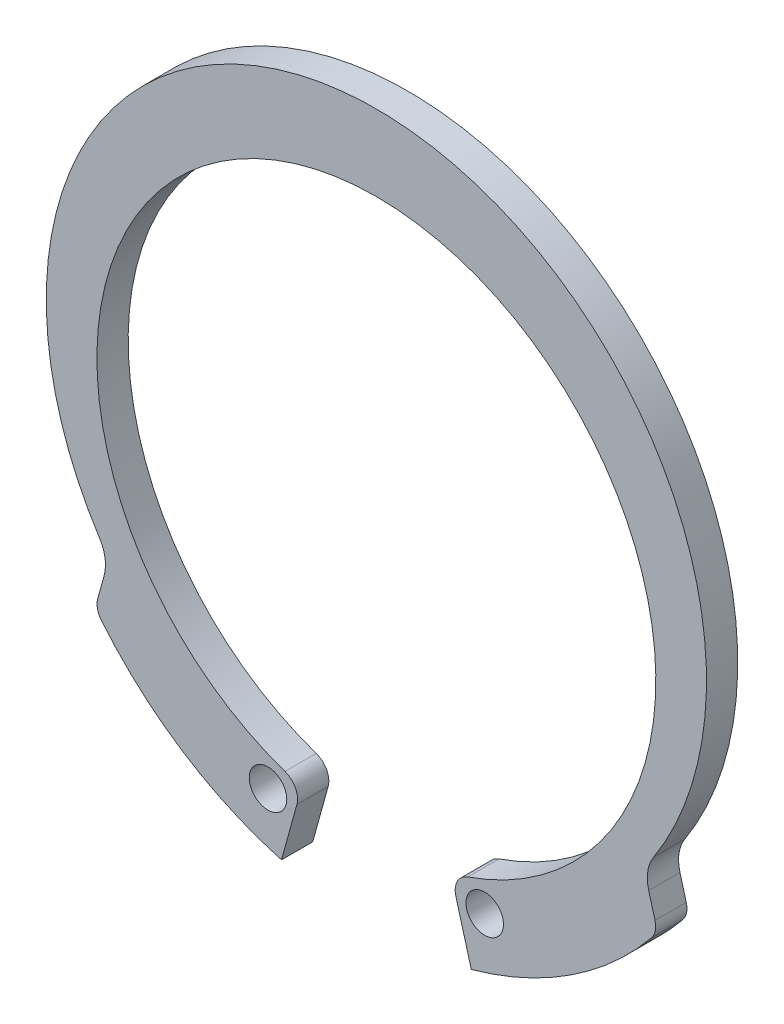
from build123d import *

# Parameters (mm, degrees)
BODYSKE_R  = 0.5334
BODY_DEPTH = 0.889


with BuildPart() as part:
    # BodySke → Body (new body)
    with BuildSketch(Plane.XY):
        with BuildLine():
            Line((-2.261226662, -8.159277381), (-2.699857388, -9.742006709))
            ThreePointArc((-2.699857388, -9.742006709), (-5.521902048, -8.467852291), (-7.825915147, -6.39929502))
            ThreePointArc((-7.825915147, -6.39929502), (-7.934942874, -6.17155616), (-7.927015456, -5.919188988))
            Line((-7.927015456, -5.919188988), (-7.747286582, -5.270665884))
            ThreePointArc((-7.747286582, -5.270665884), (-7.720288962, -4.814324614), (-7.882791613, -4.387043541))
            ThreePointArc((-7.882791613, -4.387043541), (0, 10.1092), (7.882791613, -4.387043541))
            ThreePointArc((7.882791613, -4.387043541), (7.720288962, -4.814324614), (7.747286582, -5.270665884))
            Line((7.747286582, -5.270665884), (7.927015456, -5.919188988))
            ThreePointArc((7.927015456, -5.919188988), (7.934942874, -6.17155616), (7.825915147, -6.39929502))
            ThreePointArc((7.825915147, -6.39929502), (5.521902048, -8.467852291), (2.699857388, -9.742006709))
            Line((2.699857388, -9.742006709), (2.261226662, -8.159277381))
            ThreePointArc((2.261226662, -8.159277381), (2.303016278, -7.76881282), (2.600760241, -7.512770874))
            ThreePointArc((2.600760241, -7.512770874), (0, 7.9502), (-2.600760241, -7.512770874))
            ThreePointArc((-2.600760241, -7.512770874), (-2.303016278, -7.76881282), (-2.261226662, -8.159277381))
        make_face()
        with Locations((3.082849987, -8.175676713)):
            Circle(BODYSKE_R, mode=Mode.SUBTRACT)
        with Locations((-3.082849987, -8.175676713)):
            Circle(BODYSKE_R, mode=Mode.SUBTRACT)
    extrude(amount=-BODY_DEPTH)


solid = part.part
